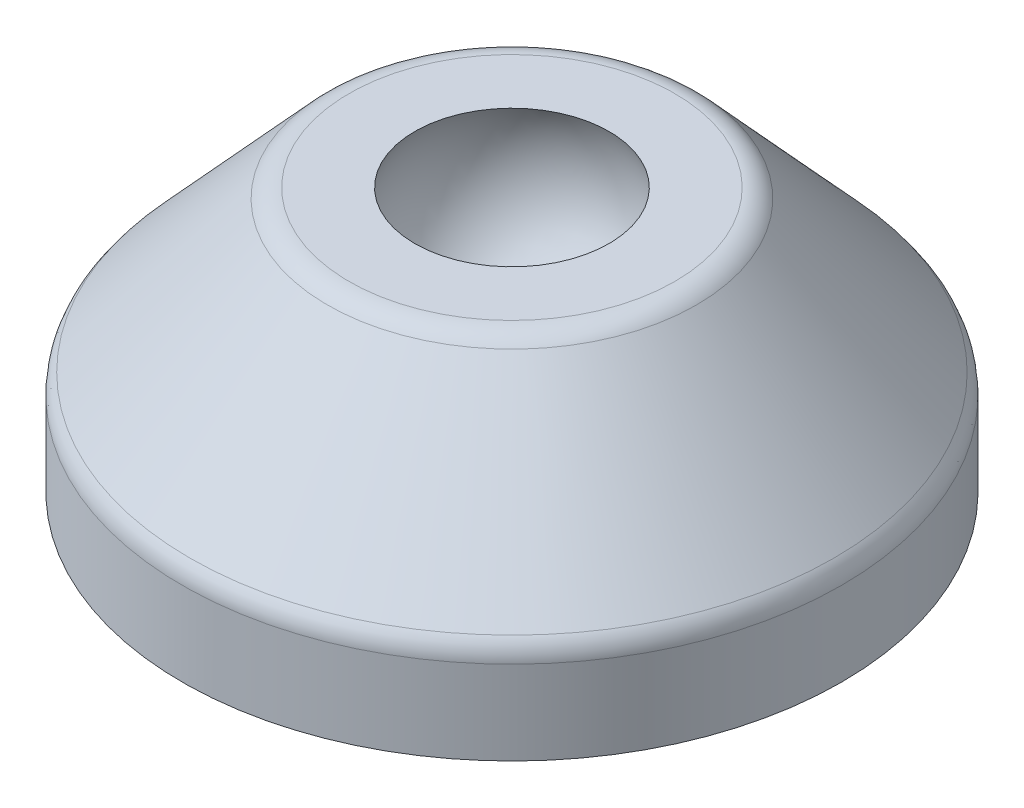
ISO-10303-21;
HEADER;
FILE_DESCRIPTION(('STEP AP214'),'2;1');
FILE_NAME('part.step','',(''),(''),'','','');
FILE_SCHEMA(('AUTOMOTIVE_DESIGN { 1 0 10303 214 1 1 1 1 }'));
ENDSEC;
DATA;
#1=APPLICATION_CONTEXT('core data for automotive mechanical design processes');
#2=APPLICATION_PROTOCOL_DEFINITION('international standard','automotive_design',2000,#1);
#3=PRODUCT_CONTEXT('',#1,'mechanical');
#4=PRODUCT('Part','Part','',(#3));
#5=PRODUCT_RELATED_PRODUCT_CATEGORY('part','',(#4));
#6=PRODUCT_DEFINITION_FORMATION('','',#4);
#7=PRODUCT_DEFINITION_CONTEXT('part definition',#1,'design');
#8=PRODUCT_DEFINITION('design','',#6,#7);
#9=PRODUCT_DEFINITION_SHAPE('','',#8);
#10=(LENGTH_UNIT() NAMED_UNIT(*) SI_UNIT(.MILLI.,.METRE.));
#11=(NAMED_UNIT(*) PLANE_ANGLE_UNIT() SI_UNIT($,.RADIAN.));
#12=(NAMED_UNIT(*) SI_UNIT($,.STERADIAN.) SOLID_ANGLE_UNIT());
#13=UNCERTAINTY_MEASURE_WITH_UNIT(LENGTH_MEASURE(1.E-05),#10,'distance_accuracy_value','');
#14=(GEOMETRIC_REPRESENTATION_CONTEXT(3) GLOBAL_UNCERTAINTY_ASSIGNED_CONTEXT((#13)) GLOBAL_UNIT_ASSIGNED_CONTEXT((#10,
#11,#12)) REPRESENTATION_CONTEXT('',''));
#15=CARTESIAN_POINT('',(0.,0.,0.));
#16=DIRECTION('',(0.,0.,1.));
#17=DIRECTION('',(1.,0.,0.));
#18=AXIS2_PLACEMENT_3D('',#15,#16,#17);
#19=CARTESIAN_POINT('',(0.,0.999999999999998,0.));
#20=DIRECTION('',(0.,1.,0.));
#21=DIRECTION('',(0.,0.,1.));
#22=AXIS2_PLACEMENT_3D('',#19,#20,#21);
#23=PLANE('',#22);
#24=CARTESIAN_POINT('',(0.,0.999999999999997,0.));
#25=DIRECTION('',(0.,1.,0.));
#26=DIRECTION('',(-1.,0.,0.));
#27=AXIS2_PLACEMENT_3D('',#24,#25,#26);
#28=CIRCLE('',#27,7.5);
#29=CARTESIAN_POINT('',(-7.5,0.999999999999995,0.));
#30=VERTEX_POINT('',#29);
#31=EDGE_CURVE('E18',#30,#30,#28,.T.);
#32=ORIENTED_EDGE('',*,*,#31,.F.);
#33=EDGE_LOOP('',(#32));
#34=FACE_BOUND('',#33,.T.);
#35=ADVANCED_FACE('F14',(#34),#23,.F.);
#36=CARTESIAN_POINT('',(0.,0.,0.));
#37=DIRECTION('',(0.,1.,0.));
#38=DIRECTION('',(-1.,0.,0.));
#39=AXIS2_PLACEMENT_3D('',#36,#37,#38);
#40=CYLINDRICAL_SURFACE('',#39,7.5);
#41=CARTESIAN_POINT('',(0.,5.,0.));
#42=DIRECTION('',(0.,1.,0.));
#43=DIRECTION('',(-1.,0.,0.));
#44=AXIS2_PLACEMENT_3D('',#41,#42,#43);
#45=CIRCLE('',#44,7.5);
#46=CARTESIAN_POINT('',(-7.5,5.,0.));
#47=VERTEX_POINT('',#46);
#48=EDGE_CURVE('E72',#47,#47,#45,.F.);
#49=ORIENTED_EDGE('',*,*,#48,.T.);
#50=EDGE_LOOP('',(#49));
#51=FACE_BOUND('',#50,.T.);
#52=ORIENTED_EDGE('',*,*,#31,.T.);
#53=EDGE_LOOP('',(#52));
#54=FACE_BOUND('',#53,.T.);
#55=ADVANCED_FACE('F79',(#51,#54),#40,.T.);
#56=CARTESIAN_POINT('',(0.,5.,0.));
#57=DIRECTION('',(0.,1.,0.));
#58=DIRECTION('',(0.,0.,1.));
#59=AXIS2_PLACEMENT_3D('',#56,#57,#58);
#60=PLANE('',#59);
#61=ORIENTED_EDGE('',*,*,#48,.F.);
#62=EDGE_LOOP('',(#61));
#63=FACE_BOUND('',#62,.T.);
#64=CARTESIAN_POINT('',(0.,5.,0.));
#65=DIRECTION('',(0.,1.,0.));
#66=DIRECTION('',(0.,0.,1.));
#67=AXIS2_PLACEMENT_3D('',#64,#65,#66);
#68=CIRCLE('',#67,18.5);
#69=CARTESIAN_POINT('',(0.,5.,18.5));
#70=VERTEX_POINT('',#69);
#71=EDGE_CURVE('E70',#70,#70,#68,.F.);
#72=ORIENTED_EDGE('',*,*,#71,.T.);
#73=EDGE_LOOP('',(#72));
#74=FACE_BOUND('',#73,.T.);
#75=ADVANCED_FACE('F86',(#63,#74),#60,.F.);
#76=CARTESIAN_POINT('',(0.,0.,0.));
#77=DIRECTION('',(0.,1.,0.));
#78=DIRECTION('',(0.,0.,1.));
#79=AXIS2_PLACEMENT_3D('',#76,#77,#78);
#80=CYLINDRICAL_SURFACE('',#79,18.5);
#81=CARTESIAN_POINT('',(0.,0.,0.));
#82=DIRECTION('',(0.,1.,0.));
#83=DIRECTION('',(0.,0.,1.));
#84=AXIS2_PLACEMENT_3D('',#81,#82,#83);
#85=CIRCLE('',#84,18.5);
#86=CARTESIAN_POINT('',(0.,0.,18.5));
#87=VERTEX_POINT('',#86);
#88=EDGE_CURVE('E67',#87,#87,#85,.T.);
#89=ORIENTED_EDGE('',*,*,#88,.F.);
#90=EDGE_LOOP('',(#89));
#91=FACE_BOUND('',#90,.T.);
#92=ORIENTED_EDGE('',*,*,#71,.F.);
#93=EDGE_LOOP('',(#92));
#94=FACE_BOUND('',#93,.T.);
#95=ADVANCED_FACE('F122',(#91,#94),#80,.F.);
#96=CARTESIAN_POINT('',(11.25,0.,0.));
#97=DIRECTION('',(0.,-1.,0.));
#98=DIRECTION('',(0.,0.,-1.));
#99=AXIS2_PLACEMENT_3D('',#96,#97,#98);
#100=PLANE('',#99);
#101=ORIENTED_EDGE('',*,*,#88,.T.);
#102=EDGE_LOOP('',(#101));
#103=FACE_BOUND('',#102,.T.);
#104=CARTESIAN_POINT('',(0.,0.,0.));
#105=DIRECTION('',(0.,-1.,0.));
#106=DIRECTION('',(1.,0.,0.));
#107=AXIS2_PLACEMENT_3D('',#104,#105,#106);
#108=CIRCLE('',#107,22.5);
#109=CARTESIAN_POINT('',(22.5,0.,0.));
#110=VERTEX_POINT('',#109);
#111=EDGE_CURVE('E64',#110,#110,#108,.F.);
#112=ORIENTED_EDGE('',*,*,#111,.F.);
#113=EDGE_LOOP('',(#112));
#114=FACE_BOUND('',#113,.T.);
#115=ADVANCED_FACE('F119',(#103,#114),#100,.T.);
#116=CARTESIAN_POINT('',(0.,14.5,0.));
#117=DIRECTION('',(0.,0.,1.));
#118=DIRECTION('',(1.,0.,0.));
#119=AXIS2_PLACEMENT_3D('',#116,#117,#118);
#120=SPHERICAL_SURFACE('',#119,7.5);
#121=CARTESIAN_POINT('',(0.,14.5,0.));
#122=DIRECTION('',(0.,1.,0.));
#123=DIRECTION('',(0.,0.,1.));
#124=AXIS2_PLACEMENT_3D('',#121,#122,#123);
#125=SPHERICAL_SURFACE('',#124,7.5);
#126=CARTESIAN_POINT('',(0.,18.,0.));
#127=DIRECTION('',(0.,1.,0.));
#128=DIRECTION('',(0.,0.,1.));
#129=AXIS2_PLACEMENT_3D('',#126,#127,#128);
#130=CIRCLE('',#129,6.6332495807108);
#131=CARTESIAN_POINT('',(0.,18.,6.6332495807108));
#132=VERTEX_POINT('',#131);
#133=EDGE_CURVE('E55',#132,#132,#130,.F.);
#134=ORIENTED_EDGE('',*,*,#133,.F.);
#135=EDGE_LOOP('',(#134));
#136=FACE_BOUND('',#135,.T.);
#137=ADVANCED_FACE('F16',(#136),#125,.F.);
#138=CARTESIAN_POINT('',(0.,2.86215128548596,0.));
#139=DIRECTION('',(0.,-1.,0.));
#140=DIRECTION('',(1.,0.,0.));
#141=AXIS2_PLACEMENT_3D('',#138,#139,#140);
#142=CYLINDRICAL_SURFACE('',#141,22.5);
#143=CARTESIAN_POINT('',(0.,5.72430257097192,0.));
#144=DIRECTION('',(0.,-1.,0.));
#145=DIRECTION('',(0.,0.,-1.));
#146=AXIS2_PLACEMENT_3D('',#143,#144,#145);
#147=CIRCLE('',#146,22.5);
#148=CARTESIAN_POINT('',(0.,5.72430257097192,-22.5));
#149=VERTEX_POINT('',#148);
#150=EDGE_CURVE('E63',#149,#149,#147,.F.);
#151=ORIENTED_EDGE('',*,*,#150,.F.);
#152=EDGE_LOOP('',(#151));
#153=FACE_BOUND('',#152,.T.);
#154=ORIENTED_EDGE('',*,*,#111,.T.);
#155=EDGE_LOOP('',(#154));
#156=FACE_BOUND('',#155,.T.);
#157=ADVANCED_FACE('F115',(#153,#156),#142,.T.);
#158=CARTESIAN_POINT('',(8.87554552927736,18.,0.));
#159=DIRECTION('',(0.,1.,0.));
#160=DIRECTION('',(0.,0.,1.));
#161=AXIS2_PLACEMENT_3D('',#158,#159,#160);
#162=PLANE('',#161);
#163=ORIENTED_EDGE('',*,*,#133,.T.);
#164=EDGE_LOOP('',(#163));
#165=FACE_BOUND('',#164,.T.);
#166=CARTESIAN_POINT('',(0.,18.,0.));
#167=DIRECTION('',(0.,-1.,0.));
#168=DIRECTION('',(1.,0.,0.));
#169=AXIS2_PLACEMENT_3D('',#166,#167,#168);
#170=CIRCLE('',#169,11.1178414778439);
#171=CARTESIAN_POINT('',(11.1178414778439,18.,0.));
#172=VERTEX_POINT('',#171);
#173=EDGE_CURVE('E27',#172,#172,#170,.T.);
#174=ORIENTED_EDGE('',*,*,#173,.F.);
#175=EDGE_LOOP('',(#174));
#176=FACE_BOUND('',#175,.T.);
#177=ADVANCED_FACE('F96',(#165,#176),#162,.T.);
#178=CARTESIAN_POINT('',(0.,5.72430257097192,0.));
#179=DIRECTION('',(0.,-1.,0.));
#180=DIRECTION('',(0.,0.,-1.));
#181=AXIS2_PLACEMENT_3D('',#178,#179,#180);
#182=TOROIDAL_SURFACE('',#181,20.5,2.);
#183=CARTESIAN_POINT('',(0.,7.07284129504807,0.));
#184=DIRECTION('',(0.,-1.,0.));
#185=DIRECTION('',(1.,0.,0.));
#186=AXIS2_PLACEMENT_3D('',#183,#184,#185);
#187=CIRCLE('',#186,21.976970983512);
#188=CARTESIAN_POINT('',(21.976970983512,7.07284129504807,0.));
#189=VERTEX_POINT('',#188);
#190=EDGE_CURVE('E22',#189,#189,#187,.F.);
#191=ORIENTED_EDGE('',*,*,#190,.F.);
#192=EDGE_LOOP('',(#191));
#193=FACE_BOUND('',#192,.T.);
#194=ORIENTED_EDGE('',*,*,#150,.T.);
#195=EDGE_LOOP('',(#194));
#196=FACE_BOUND('',#195,.T.);
#197=ADVANCED_FACE('F45',(#193,#196),#182,.T.);
#198=CARTESIAN_POINT('',(0.,16.,0.));
#199=DIRECTION('',(0.,-1.,0.));
#200=DIRECTION('',(0.,0.,-1.));
#201=AXIS2_PLACEMENT_3D('',#198,#199,#200);
#202=TOROIDAL_SURFACE('',#201,11.1178414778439,2.);
#203=ORIENTED_EDGE('',*,*,#173,.T.);
#204=EDGE_LOOP('',(#203));
#205=FACE_BOUND('',#204,.T.);
#206=CARTESIAN_POINT('',(0.,17.3485387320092,0.));
#207=DIRECTION('',(0.,-1.,0.));
#208=DIRECTION('',(1.,0.,0.));
#209=AXIS2_PLACEMENT_3D('',#206,#207,#208);
#210=CIRCLE('',#209,12.5948124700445);
#211=CARTESIAN_POINT('',(12.5948124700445,17.3485387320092,0.));
#212=VERTEX_POINT('',#211);
#213=EDGE_CURVE('E10',#212,#212,#210,.T.);
#214=ORIENTED_EDGE('',*,*,#213,.F.);
#215=EDGE_LOOP('',(#214));
#216=FACE_BOUND('',#215,.T.);
#217=ADVANCED_FACE('F39',(#205,#216),#202,.T.);
#218=CARTESIAN_POINT('',(0.,7.07284129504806,0.));
#219=DIRECTION('',(0.,-1.,0.));
#220=DIRECTION('',(1.,0.,0.));
#221=AXIS2_PLACEMENT_3D('',#218,#219,#220);
#222=CONICAL_SURFACE('',#221,21.976970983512,0.739974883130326);
#223=ORIENTED_EDGE('',*,*,#213,.T.);
#224=EDGE_LOOP('',(#223));
#225=FACE_BOUND('',#224,.T.);
#226=ORIENTED_EDGE('',*,*,#190,.T.);
#227=EDGE_LOOP('',(#226));
#228=FACE_BOUND('',#227,.T.);
#229=ADVANCED_FACE('F44',(#225,#228),#222,.T.);
#230=CLOSED_SHELL('',(#35,#55,#75,#95,#115,#137,#157,#177,#197,#217,#229));
#231=MANIFOLD_SOLID_BREP('B1',#230);
#232=ADVANCED_BREP_SHAPE_REPRESENTATION('',(#18,#231),#14);
#233=SHAPE_DEFINITION_REPRESENTATION(#9,#232);
ENDSEC;
END-ISO-10303-21;
